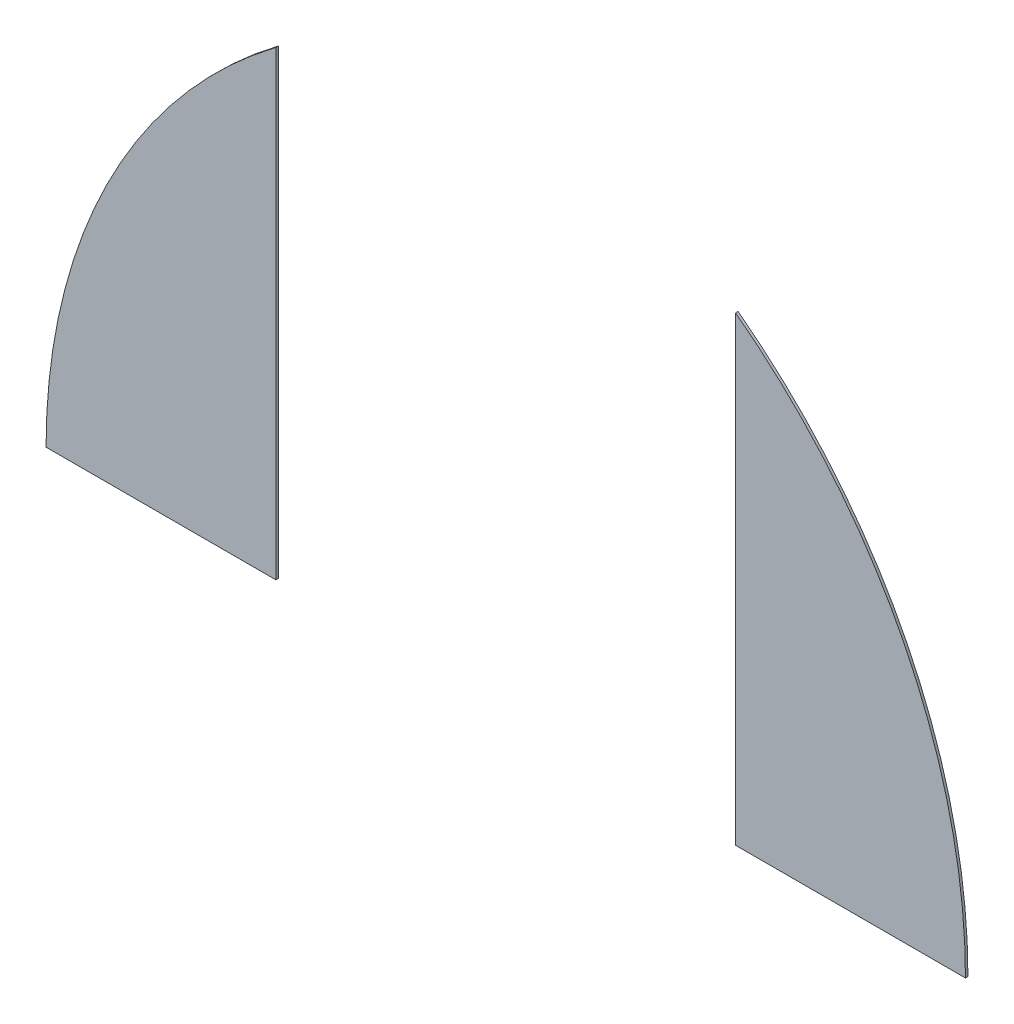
ISO-10303-21;
HEADER;
FILE_DESCRIPTION(('STEP AP214'),'2;1');
FILE_NAME('part.step','',(''),(''),'','','');
FILE_SCHEMA(('AUTOMOTIVE_DESIGN { 1 0 10303 214 1 1 1 1 }'));
ENDSEC;
DATA;
#1=APPLICATION_CONTEXT('core data for automotive mechanical design processes');
#2=APPLICATION_PROTOCOL_DEFINITION('international standard','automotive_design',2000,#1);
#3=PRODUCT_CONTEXT('',#1,'mechanical');
#4=PRODUCT('Part','Part','',(#3));
#5=PRODUCT_RELATED_PRODUCT_CATEGORY('part','',(#4));
#6=PRODUCT_DEFINITION_FORMATION('','',#4);
#7=PRODUCT_DEFINITION_CONTEXT('part definition',#1,'design');
#8=PRODUCT_DEFINITION('design','',#6,#7);
#9=PRODUCT_DEFINITION_SHAPE('','',#8);
#10=(LENGTH_UNIT() NAMED_UNIT(*) SI_UNIT(.MILLI.,.METRE.));
#11=(NAMED_UNIT(*) PLANE_ANGLE_UNIT() SI_UNIT($,.RADIAN.));
#12=(NAMED_UNIT(*) SI_UNIT($,.STERADIAN.) SOLID_ANGLE_UNIT());
#13=UNCERTAINTY_MEASURE_WITH_UNIT(LENGTH_MEASURE(1.E-05),#10,'distance_accuracy_value','');
#14=(GEOMETRIC_REPRESENTATION_CONTEXT(3) GLOBAL_UNCERTAINTY_ASSIGNED_CONTEXT((#13)) GLOBAL_UNIT_ASSIGNED_CONTEXT((#10,
#11,#12)) REPRESENTATION_CONTEXT('',''));
#15=CARTESIAN_POINT('',(0.,0.,0.));
#16=DIRECTION('',(0.,0.,1.));
#17=DIRECTION('',(1.,0.,0.));
#18=AXIS2_PLACEMENT_3D('',#15,#16,#17);
#19=CARTESIAN_POINT('',(-343.048929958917,-678.013291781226,7.));
#20=DIRECTION('',(0.,0.,-1.));
#21=DIRECTION('',(-1.,0.,0.));
#22=AXIS2_PLACEMENT_3D('',#19,#20,#21);
#23=CYLINDRICAL_SURFACE('',#22,1633.03652149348);
#24=CARTESIAN_POINT('',(-343.048929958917,-678.013291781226,0.));
#25=DIRECTION('',(0.,0.,1.));
#26=DIRECTION('',(1.,0.,0.));
#27=AXIS2_PLACEMENT_3D('',#24,#25,#26);
#28=CIRCLE('',#27,1633.03652149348);
#29=CARTESIAN_POINT('',(1289.98759153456,-678.013291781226,0.));
#30=VERTEX_POINT('',#29);
#31=CARTESIAN_POINT('',(639.987591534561,625.99877792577,0.));
#32=VERTEX_POINT('',#31);
#33=EDGE_CURVE('E89',#30,#32,#28,.T.);
#34=ORIENTED_EDGE('',*,*,#33,.T.);
#35=DIRECTION('',(0.,0.,-1.));
#36=VECTOR('',#35,1.);
#37=CARTESIAN_POINT('',(639.987591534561,625.99877792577,7.));
#38=LINE('',#37,#36);
#39=CARTESIAN_POINT('',(639.987591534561,625.99877792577,7.));
#40=VERTEX_POINT('',#39);
#41=EDGE_CURVE('E12',#40,#32,#38,.T.);
#42=ORIENTED_EDGE('',*,*,#41,.F.);
#43=CARTESIAN_POINT('',(-343.048929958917,-678.013291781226,7.));
#44=DIRECTION('',(0.,0.,1.));
#45=DIRECTION('',(1.,0.,0.));
#46=AXIS2_PLACEMENT_3D('',#43,#44,#45);
#47=CIRCLE('',#46,1633.03652149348);
#48=CARTESIAN_POINT('',(1289.98759153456,-678.013291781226,7.));
#49=VERTEX_POINT('',#48);
#50=EDGE_CURVE('E82',#49,#40,#47,.T.);
#51=ORIENTED_EDGE('',*,*,#50,.F.);
#52=DIRECTION('',(0.,0.,-1.));
#53=VECTOR('',#52,1.);
#54=CARTESIAN_POINT('',(1289.98759153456,-678.013291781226,7.));
#55=LINE('',#54,#53);
#56=EDGE_CURVE('E90',#49,#30,#55,.T.);
#57=ORIENTED_EDGE('',*,*,#56,.T.);
#58=EDGE_LOOP('',(#34,#42,#51,#57));
#59=FACE_BOUND('',#58,.T.);
#60=ADVANCED_FACE('F42',(#59),#23,.T.);
#61=CARTESIAN_POINT('',(639.987591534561,625.99877792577,7.));
#62=DIRECTION('',(1.,0.,0.));
#63=DIRECTION('',(0.,0.,-1.));
#64=AXIS2_PLACEMENT_3D('',#61,#62,#63);
#65=PLANE('',#64);
#66=DIRECTION('',(0.,-1.,0.));
#67=VECTOR('',#66,1.);
#68=CARTESIAN_POINT('',(639.987591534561,625.99877792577,0.));
#69=LINE('',#68,#67);
#70=CARTESIAN_POINT('',(639.987591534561,-678.013291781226,0.));
#71=VERTEX_POINT('',#70);
#72=EDGE_CURVE('E70',#32,#71,#69,.T.);
#73=ORIENTED_EDGE('',*,*,#72,.T.);
#74=DIRECTION('',(0.,0.,-1.));
#75=VECTOR('',#74,1.);
#76=CARTESIAN_POINT('',(639.987591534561,-678.013291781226,7.));
#77=LINE('',#76,#75);
#78=CARTESIAN_POINT('',(639.987591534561,-678.013291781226,7.));
#79=VERTEX_POINT('',#78);
#80=EDGE_CURVE('E50',#79,#71,#77,.T.);
#81=ORIENTED_EDGE('',*,*,#80,.F.);
#82=DIRECTION('',(0.,-1.,0.));
#83=VECTOR('',#82,1.);
#84=CARTESIAN_POINT('',(639.987591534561,625.99877792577,7.));
#85=LINE('',#84,#83);
#86=EDGE_CURVE('E78',#40,#79,#85,.T.);
#87=ORIENTED_EDGE('',*,*,#86,.F.);
#88=ORIENTED_EDGE('',*,*,#41,.T.);
#89=EDGE_LOOP('',(#73,#81,#87,#88));
#90=FACE_BOUND('',#89,.T.);
#91=ADVANCED_FACE('F79',(#90),#65,.F.);
#92=CARTESIAN_POINT('',(1289.98759153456,-678.013291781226,7.));
#93=DIRECTION('',(0.,1.,0.));
#94=DIRECTION('',(-1.,0.,0.));
#95=AXIS2_PLACEMENT_3D('',#92,#93,#94);
#96=PLANE('',#95);
#97=DIRECTION('',(1.,0.,0.));
#98=VECTOR('',#97,1.);
#99=CARTESIAN_POINT('',(1289.98759153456,-678.013291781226,0.));
#100=LINE('',#99,#98);
#101=EDGE_CURVE('E75',#71,#30,#100,.T.);
#102=ORIENTED_EDGE('',*,*,#101,.T.);
#103=ORIENTED_EDGE('',*,*,#56,.F.);
#104=DIRECTION('',(1.,0.,0.));
#105=VECTOR('',#104,1.);
#106=CARTESIAN_POINT('',(1289.98759153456,-678.013291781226,7.));
#107=LINE('',#106,#105);
#108=EDGE_CURVE('E58',#79,#49,#107,.T.);
#109=ORIENTED_EDGE('',*,*,#108,.F.);
#110=ORIENTED_EDGE('',*,*,#80,.T.);
#111=EDGE_LOOP('',(#102,#103,#109,#110));
#112=FACE_BOUND('',#111,.T.);
#113=ADVANCED_FACE('F97',(#112),#96,.F.);
#114=CARTESIAN_POINT('',(-343.048929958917,-678.013291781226,7.));
#115=DIRECTION('',(0.,0.,1.));
#116=DIRECTION('',(1.,0.,0.));
#117=AXIS2_PLACEMENT_3D('',#114,#115,#116);
#118=PLANE('',#117);
#119=ORIENTED_EDGE('',*,*,#50,.T.);
#120=ORIENTED_EDGE('',*,*,#86,.T.);
#121=ORIENTED_EDGE('',*,*,#108,.T.);
#122=EDGE_LOOP('',(#119,#120,#121));
#123=FACE_BOUND('',#122,.T.);
#124=ADVANCED_FACE('F85',(#123),#118,.T.);
#125=CARTESIAN_POINT('',(-343.048929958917,-678.013291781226,0.));
#126=DIRECTION('',(0.,0.,1.));
#127=DIRECTION('',(1.,0.,0.));
#128=AXIS2_PLACEMENT_3D('',#125,#126,#127);
#129=PLANE('',#128);
#130=ORIENTED_EDGE('',*,*,#33,.F.);
#131=ORIENTED_EDGE('',*,*,#101,.F.);
#132=ORIENTED_EDGE('',*,*,#72,.F.);
#133=EDGE_LOOP('',(#130,#131,#132));
#134=FACE_BOUND('',#133,.T.);
#135=ADVANCED_FACE('F98',(#134),#129,.F.);
#136=CLOSED_SHELL('',(#60,#91,#113,#124,#135));
#137=MANIFOLD_SOLID_BREP('B2',#136);
#138=CARTESIAN_POINT('',(323.024113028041,-678.013291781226,7.));
#139=DIRECTION('',(0.,0.,-1.));
#140=DIRECTION('',(-1.,0.,0.));
#141=AXIS2_PLACEMENT_3D('',#138,#139,#140);
#142=CYLINDRICAL_SURFACE('',#141,1633.03652149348);
#143=CARTESIAN_POINT('',(323.024113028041,-678.013291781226,0.));
#144=DIRECTION('',(0.,0.,1.));
#145=DIRECTION('',(-1.,0.,0.));
#146=AXIS2_PLACEMENT_3D('',#143,#144,#145);
#147=CIRCLE('',#146,1633.03652149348);
#148=CARTESIAN_POINT('',(-660.012408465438,625.998777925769,0.));
#149=VERTEX_POINT('',#148);
#150=CARTESIAN_POINT('',(-1310.01240846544,-678.013291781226,0.));
#151=VERTEX_POINT('',#150);
#152=EDGE_CURVE('E186',#149,#151,#147,.T.);
#153=ORIENTED_EDGE('',*,*,#152,.T.);
#154=DIRECTION('',(0.,0.,-1.));
#155=VECTOR('',#154,1.);
#156=CARTESIAN_POINT('',(-1310.01240846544,-678.013291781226,7.));
#157=LINE('',#156,#155);
#158=CARTESIAN_POINT('',(-1310.01240846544,-678.013291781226,7.));
#159=VERTEX_POINT('',#158);
#160=EDGE_CURVE('E40',#159,#151,#157,.T.);
#161=ORIENTED_EDGE('',*,*,#160,.F.);
#162=CARTESIAN_POINT('',(323.024113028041,-678.013291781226,7.));
#163=DIRECTION('',(0.,0.,1.));
#164=DIRECTION('',(-1.,0.,0.));
#165=AXIS2_PLACEMENT_3D('',#162,#163,#164);
#166=CIRCLE('',#165,1633.03652149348);
#167=CARTESIAN_POINT('',(-660.012408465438,625.998777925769,7.));
#168=VERTEX_POINT('',#167);
#169=EDGE_CURVE('E179',#168,#159,#166,.T.);
#170=ORIENTED_EDGE('',*,*,#169,.F.);
#171=DIRECTION('',(0.,0.,-1.));
#172=VECTOR('',#171,1.);
#173=CARTESIAN_POINT('',(-660.012408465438,625.998777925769,7.));
#174=LINE('',#173,#172);
#175=EDGE_CURVE('E187',#168,#149,#174,.T.);
#176=ORIENTED_EDGE('',*,*,#175,.T.);
#177=EDGE_LOOP('',(#153,#161,#170,#176));
#178=FACE_BOUND('',#177,.T.);
#179=ADVANCED_FACE('F139',(#178),#142,.T.);
#180=CARTESIAN_POINT('',(-1310.01240846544,-678.013291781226,7.));
#181=DIRECTION('',(0.,1.,0.));
#182=DIRECTION('',(-1.,0.,0.));
#183=AXIS2_PLACEMENT_3D('',#180,#181,#182);
#184=PLANE('',#183);
#185=DIRECTION('',(1.,0.,0.));
#186=VECTOR('',#185,1.);
#187=CARTESIAN_POINT('',(-1310.01240846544,-678.013291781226,0.));
#188=LINE('',#187,#186);
#189=CARTESIAN_POINT('',(-660.012408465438,-678.013291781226,0.));
#190=VERTEX_POINT('',#189);
#191=EDGE_CURVE('E167',#151,#190,#188,.T.);
#192=ORIENTED_EDGE('',*,*,#191,.T.);
#193=DIRECTION('',(0.,0.,-1.));
#194=VECTOR('',#193,1.);
#195=CARTESIAN_POINT('',(-660.012408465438,-678.013291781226,7.));
#196=LINE('',#195,#194);
#197=CARTESIAN_POINT('',(-660.012408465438,-678.013291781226,7.));
#198=VERTEX_POINT('',#197);
#199=EDGE_CURVE('E147',#198,#190,#196,.T.);
#200=ORIENTED_EDGE('',*,*,#199,.F.);
#201=DIRECTION('',(1.,0.,0.));
#202=VECTOR('',#201,1.);
#203=CARTESIAN_POINT('',(-1310.01240846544,-678.013291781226,7.));
#204=LINE('',#203,#202);
#205=EDGE_CURVE('E175',#159,#198,#204,.T.);
#206=ORIENTED_EDGE('',*,*,#205,.F.);
#207=ORIENTED_EDGE('',*,*,#160,.T.);
#208=EDGE_LOOP('',(#192,#200,#206,#207));
#209=FACE_BOUND('',#208,.T.);
#210=ADVANCED_FACE('F176',(#209),#184,.F.);
#211=CARTESIAN_POINT('',(-660.012408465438,625.998777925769,7.));
#212=DIRECTION('',(-1.,0.,0.));
#213=DIRECTION('',(0.,-1.,0.));
#214=AXIS2_PLACEMENT_3D('',#211,#212,#213);
#215=PLANE('',#214);
#216=DIRECTION('',(0.,1.,0.));
#217=VECTOR('',#216,1.);
#218=CARTESIAN_POINT('',(-660.012408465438,625.998777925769,0.));
#219=LINE('',#218,#217);
#220=EDGE_CURVE('E172',#190,#149,#219,.T.);
#221=ORIENTED_EDGE('',*,*,#220,.T.);
#222=ORIENTED_EDGE('',*,*,#175,.F.);
#223=DIRECTION('',(0.,1.,0.));
#224=VECTOR('',#223,1.);
#225=CARTESIAN_POINT('',(-660.012408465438,625.998777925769,7.));
#226=LINE('',#225,#224);
#227=EDGE_CURVE('E155',#198,#168,#226,.T.);
#228=ORIENTED_EDGE('',*,*,#227,.F.);
#229=ORIENTED_EDGE('',*,*,#199,.T.);
#230=EDGE_LOOP('',(#221,#222,#228,#229));
#231=FACE_BOUND('',#230,.T.);
#232=ADVANCED_FACE('F194',(#231),#215,.F.);
#233=CARTESIAN_POINT('',(323.024113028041,-678.013291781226,7.));
#234=DIRECTION('',(0.,0.,-1.));
#235=DIRECTION('',(-1.,0.,0.));
#236=AXIS2_PLACEMENT_3D('',#233,#234,#235);
#237=PLANE('',#236);
#238=ORIENTED_EDGE('',*,*,#169,.T.);
#239=ORIENTED_EDGE('',*,*,#205,.T.);
#240=ORIENTED_EDGE('',*,*,#227,.T.);
#241=EDGE_LOOP('',(#238,#239,#240));
#242=FACE_BOUND('',#241,.T.);
#243=ADVANCED_FACE('F182',(#242),#237,.F.);
#244=CARTESIAN_POINT('',(323.024113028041,-678.013291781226,0.));
#245=DIRECTION('',(0.,0.,-1.));
#246=DIRECTION('',(-1.,0.,0.));
#247=AXIS2_PLACEMENT_3D('',#244,#245,#246);
#248=PLANE('',#247);
#249=ORIENTED_EDGE('',*,*,#152,.F.);
#250=ORIENTED_EDGE('',*,*,#220,.F.);
#251=ORIENTED_EDGE('',*,*,#191,.F.);
#252=EDGE_LOOP('',(#249,#250,#251));
#253=FACE_BOUND('',#252,.T.);
#254=ADVANCED_FACE('F195',(#253),#248,.T.);
#255=CLOSED_SHELL('',(#179,#210,#232,#243,#254));
#256=MANIFOLD_SOLID_BREP('B6',#255);
#257=ADVANCED_BREP_SHAPE_REPRESENTATION('',(#18,#137,#256),#14);
#258=SHAPE_DEFINITION_REPRESENTATION(#9,#257);
ENDSEC;
END-ISO-10303-21;
